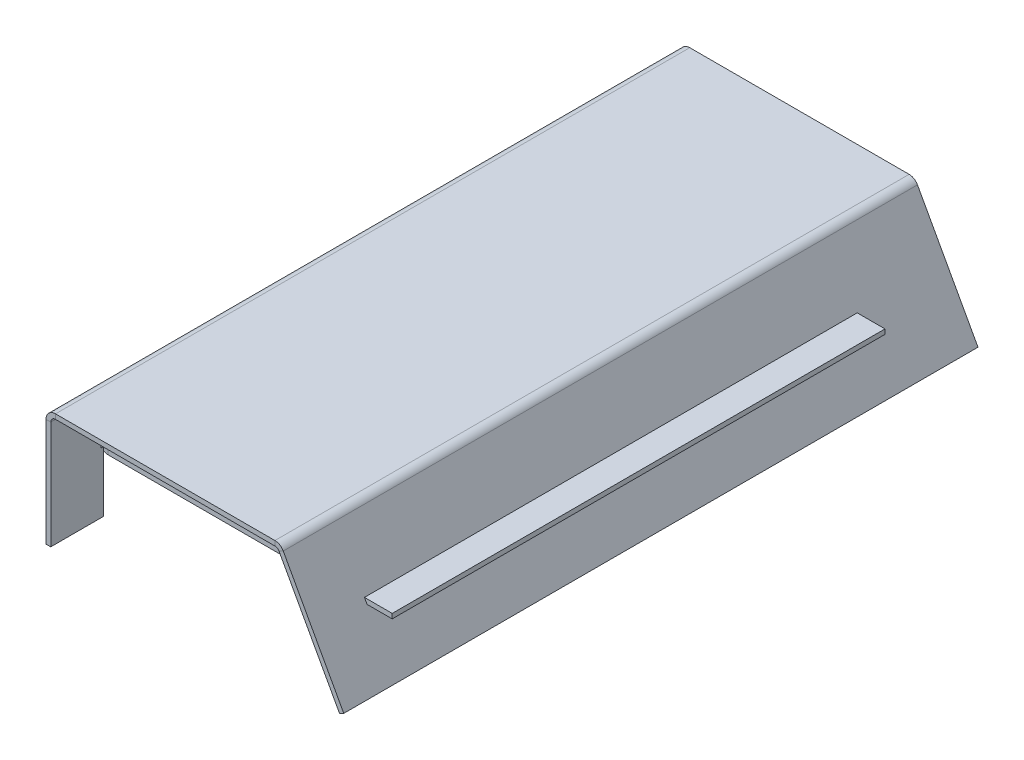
ISO-10303-21;
HEADER;
FILE_DESCRIPTION(('STEP AP214'),'2;1');
FILE_NAME('part.step','',(''),(''),'','','');
FILE_SCHEMA(('AUTOMOTIVE_DESIGN { 1 0 10303 214 1 1 1 1 }'));
ENDSEC;
DATA;
#1=APPLICATION_CONTEXT('core data for automotive mechanical design processes');
#2=APPLICATION_PROTOCOL_DEFINITION('international standard','automotive_design',2000,#1);
#3=PRODUCT_CONTEXT('',#1,'mechanical');
#4=PRODUCT('Part','Part','',(#3));
#5=PRODUCT_RELATED_PRODUCT_CATEGORY('part','',(#4));
#6=PRODUCT_DEFINITION_FORMATION('','',#4);
#7=PRODUCT_DEFINITION_CONTEXT('part definition',#1,'design');
#8=PRODUCT_DEFINITION('design','',#6,#7);
#9=PRODUCT_DEFINITION_SHAPE('','',#8);
#10=(LENGTH_UNIT() NAMED_UNIT(*) SI_UNIT(.MILLI.,.METRE.));
#11=(NAMED_UNIT(*) PLANE_ANGLE_UNIT() SI_UNIT($,.RADIAN.));
#12=(NAMED_UNIT(*) SI_UNIT($,.STERADIAN.) SOLID_ANGLE_UNIT());
#13=UNCERTAINTY_MEASURE_WITH_UNIT(LENGTH_MEASURE(1.E-05),#10,'distance_accuracy_value','');
#14=(GEOMETRIC_REPRESENTATION_CONTEXT(3) GLOBAL_UNCERTAINTY_ASSIGNED_CONTEXT((#13)) GLOBAL_UNIT_ASSIGNED_CONTEXT((#10,
#11,#12)) REPRESENTATION_CONTEXT('',''));
#15=CARTESIAN_POINT('',(0.,0.,0.));
#16=DIRECTION('',(0.,0.,1.));
#17=DIRECTION('',(1.,0.,0.));
#18=AXIS2_PLACEMENT_3D('',#15,#16,#17);
#19=CARTESIAN_POINT('',(-89.5814787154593,20.577072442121,183.41064428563));
#20=DIRECTION('',(0.,0.,1.));
#21=DIRECTION('',(1.,0.,0.));
#22=AXIS2_PLACEMENT_3D('',#19,#20,#21);
#23=PLANE('',#22);
#24=DIRECTION('',(0.,-1.,0.));
#25=VECTOR('',#24,1.);
#26=CARTESIAN_POINT('',(-89.5814787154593,19.077072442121,183.41064428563));
#27=LINE('',#26,#25);
#28=CARTESIAN_POINT('',(-89.5814787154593,19.077072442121,183.41064428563));
#29=VERTEX_POINT('',#28);
#30=CARTESIAN_POINT('',(-89.5814787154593,17.577072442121,183.41064428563));
#31=VERTEX_POINT('',#30);
#32=EDGE_CURVE('E835',#29,#31,#27,.T.);
#33=ORIENTED_EDGE('',*,*,#32,.F.);
#34=CARTESIAN_POINT('',(-89.5814787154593,20.577072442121,183.41064428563));
#35=DIRECTION('',(0.,0.,-1.));
#36=DIRECTION('',(-1.,0.,0.));
#37=AXIS2_PLACEMENT_3D('',#34,#35,#36);
#38=CIRCLE('',#37,1.49999999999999);
#39=CARTESIAN_POINT('',(-91.0814787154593,20.577072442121,183.41064428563));
#40=VERTEX_POINT('',#39);
#41=EDGE_CURVE('E802',#40,#29,#38,.F.);
#42=ORIENTED_EDGE('',*,*,#41,.F.);
#43=DIRECTION('',(-1.,0.,0.));
#44=VECTOR('',#43,1.);
#45=CARTESIAN_POINT('',(-91.0814787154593,20.577072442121,183.41064428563));
#46=LINE('',#45,#44);
#47=CARTESIAN_POINT('',(-92.5814787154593,20.577072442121,183.41064428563));
#48=VERTEX_POINT('',#47);
#49=EDGE_CURVE('E11',#40,#48,#46,.T.);
#50=ORIENTED_EDGE('',*,*,#49,.T.);
#51=CARTESIAN_POINT('',(-89.5814787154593,20.577072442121,183.41064428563));
#52=DIRECTION('',(0.,0.,-1.));
#53=DIRECTION('',(-1.,0.,0.));
#54=AXIS2_PLACEMENT_3D('',#51,#52,#53);
#55=CIRCLE('',#54,2.99999999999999);
#56=EDGE_CURVE('E811',#48,#31,#55,.F.);
#57=ORIENTED_EDGE('',*,*,#56,.T.);
#58=EDGE_LOOP('',(#33,#42,#50,#57));
#59=FACE_BOUND('',#58,.T.);
#60=ADVANCED_FACE('F374',(#59),#23,.T.);
#61=CARTESIAN_POINT('',(-89.5814787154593,20.577072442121,28.0181228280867));
#62=DIRECTION('',(0.,0.,1.));
#63=DIRECTION('',(1.,0.,0.));
#64=AXIS2_PLACEMENT_3D('',#61,#62,#63);
#65=PLANE('',#64);
#66=CARTESIAN_POINT('',(-89.5814787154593,20.577072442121,28.0181228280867));
#67=DIRECTION('',(0.,0.,-1.));
#68=DIRECTION('',(-1.,0.,0.));
#69=AXIS2_PLACEMENT_3D('',#66,#67,#68);
#70=CIRCLE('',#69,1.49999999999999);
#71=CARTESIAN_POINT('',(-89.5814787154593,19.077072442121,28.0181228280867));
#72=VERTEX_POINT('',#71);
#73=CARTESIAN_POINT('',(-91.0814787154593,20.577072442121,28.0181228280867));
#74=VERTEX_POINT('',#73);
#75=EDGE_CURVE('E801',#72,#74,#70,.T.);
#76=ORIENTED_EDGE('',*,*,#75,.F.);
#77=DIRECTION('',(0.,-1.,0.));
#78=VECTOR('',#77,1.);
#79=CARTESIAN_POINT('',(-89.5814787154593,19.077072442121,28.0181228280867));
#80=LINE('',#79,#78);
#81=CARTESIAN_POINT('',(-89.5814787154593,17.577072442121,28.0181228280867));
#82=VERTEX_POINT('',#81);
#83=EDGE_CURVE('E819',#72,#82,#80,.T.);
#84=ORIENTED_EDGE('',*,*,#83,.T.);
#85=CARTESIAN_POINT('',(-89.5814787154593,20.577072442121,28.0181228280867));
#86=DIRECTION('',(0.,0.,-1.));
#87=DIRECTION('',(-1.,0.,0.));
#88=AXIS2_PLACEMENT_3D('',#85,#86,#87);
#89=CIRCLE('',#88,2.99999999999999);
#90=CARTESIAN_POINT('',(-92.5814787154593,20.577072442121,28.0181228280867));
#91=VERTEX_POINT('',#90);
#92=EDGE_CURVE('E805',#82,#91,#89,.T.);
#93=ORIENTED_EDGE('',*,*,#92,.T.);
#94=DIRECTION('',(-1.,0.,0.));
#95=VECTOR('',#94,1.);
#96=CARTESIAN_POINT('',(-91.0814787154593,20.577072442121,28.0181228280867));
#97=LINE('',#96,#95);
#98=EDGE_CURVE('E378',#74,#91,#97,.T.);
#99=ORIENTED_EDGE('',*,*,#98,.F.);
#100=EDGE_LOOP('',(#76,#84,#93,#99));
#101=FACE_BOUND('',#100,.T.);
#102=ADVANCED_FACE('F376',(#101),#65,.F.);
#103=CARTESIAN_POINT('',(-89.5814787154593,20.577072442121,28.0181228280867));
#104=DIRECTION('',(0.,0.,-1.));
#105=DIRECTION('',(0.,-1.,0.));
#106=AXIS2_PLACEMENT_3D('',#103,#104,#105);
#107=CYLINDRICAL_SURFACE('',#106,2.99999999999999);
#108=DIRECTION('',(0.,0.,-1.));
#109=VECTOR('',#108,1.);
#110=CARTESIAN_POINT('',(-92.5814787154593,20.577072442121,28.0181228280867));
#111=LINE('',#110,#109);
#112=EDGE_CURVE('E389',#91,#48,#111,.F.);
#113=ORIENTED_EDGE('',*,*,#112,.F.);
#114=ORIENTED_EDGE('',*,*,#92,.F.);
#115=DIRECTION('',(0.,0.,-1.));
#116=VECTOR('',#115,1.);
#117=CARTESIAN_POINT('',(-89.5814787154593,17.577072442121,28.0181228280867));
#118=LINE('',#117,#116);
#119=EDGE_CURVE('E394',#31,#82,#118,.T.);
#120=ORIENTED_EDGE('',*,*,#119,.F.);
#121=ORIENTED_EDGE('',*,*,#56,.F.);
#122=EDGE_LOOP('',(#113,#114,#120,#121));
#123=FACE_BOUND('',#122,.T.);
#124=ADVANCED_FACE('F858',(#123),#107,.T.);
#125=CARTESIAN_POINT('',(-89.5814787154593,20.577072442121,28.0181228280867));
#126=DIRECTION('',(0.,0.,-1.));
#127=DIRECTION('',(0.,-1.,0.));
#128=AXIS2_PLACEMENT_3D('',#125,#126,#127);
#129=CYLINDRICAL_SURFACE('',#128,1.49999999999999);
#130=DIRECTION('',(0.,0.,-1.));
#131=VECTOR('',#130,1.);
#132=CARTESIAN_POINT('',(-91.0814787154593,20.577072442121,28.0181228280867));
#133=LINE('',#132,#131);
#134=EDGE_CURVE('E806',#74,#40,#133,.F.);
#135=ORIENTED_EDGE('',*,*,#134,.T.);
#136=ORIENTED_EDGE('',*,*,#41,.T.);
#137=DIRECTION('',(0.,0.,-1.));
#138=VECTOR('',#137,1.);
#139=CARTESIAN_POINT('',(-89.5814787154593,19.077072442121,183.41064428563));
#140=LINE('',#139,#138);
#141=EDGE_CURVE('E566',#29,#72,#140,.T.);
#142=ORIENTED_EDGE('',*,*,#141,.T.);
#143=ORIENTED_EDGE('',*,*,#75,.T.);
#144=EDGE_LOOP('',(#135,#136,#142,#143));
#145=FACE_BOUND('',#144,.T.);
#146=ADVANCED_FACE('F833',(#145),#129,.F.);
#147=CARTESIAN_POINT('',(-92.5814787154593,35.577072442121,200.));
#148=DIRECTION('',(1.,0.,0.));
#149=DIRECTION('',(0.,1.,0.));
#150=AXIS2_PLACEMENT_3D('',#147,#148,#149);
#151=PLANE('',#150);
#152=DIRECTION('',(0.,0.,1.));
#153=VECTOR('',#152,1.);
#154=CARTESIAN_POINT('',(-92.5814787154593,19.077072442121,200.));
#155=LINE('',#154,#153);
#156=CARTESIAN_POINT('',(-92.5814787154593,19.077072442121,27.2681228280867));
#157=VERTEX_POINT('',#156);
#158=CARTESIAN_POINT('',(-92.5814787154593,19.077072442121,28.0181228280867));
#159=VERTEX_POINT('',#158);
#160=EDGE_CURVE('E638',#157,#159,#155,.T.);
#161=ORIENTED_EDGE('',*,*,#160,.F.);
#162=DIRECTION('',(0.,-1.,0.));
#163=VECTOR('',#162,1.);
#164=CARTESIAN_POINT('',(-92.5814787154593,35.577072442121,27.2681228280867));
#165=LINE('',#164,#163);
#166=CARTESIAN_POINT('',(-92.5814787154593,21.327072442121,27.2681228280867));
#167=VERTEX_POINT('',#166);
#168=EDGE_CURVE('E656',#167,#157,#165,.T.);
#169=ORIENTED_EDGE('',*,*,#168,.F.);
#170=DIRECTION('',(0.,0.,-1.));
#171=VECTOR('',#170,1.);
#172=CARTESIAN_POINT('',(-92.5814787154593,21.327072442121,200.));
#173=LINE('',#172,#171);
#174=CARTESIAN_POINT('',(-92.5814787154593,21.327072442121,28.0181228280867));
#175=VERTEX_POINT('',#174);
#176=EDGE_CURVE('E653',#175,#167,#173,.T.);
#177=ORIENTED_EDGE('',*,*,#176,.F.);
#178=DIRECTION('',(0.,1.,0.));
#179=VECTOR('',#178,1.);
#180=CARTESIAN_POINT('',(-92.5814787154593,35.577072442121,28.0181228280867));
#181=LINE('',#180,#179);
#182=EDGE_CURVE('E650',#91,#175,#181,.T.);
#183=ORIENTED_EDGE('',*,*,#182,.F.);
#184=ORIENTED_EDGE('',*,*,#112,.T.);
#185=DIRECTION('',(0.,-1.,0.));
#186=VECTOR('',#185,1.);
#187=CARTESIAN_POINT('',(-92.5814787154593,35.577072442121,183.41064428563));
#188=LINE('',#187,#186);
#189=CARTESIAN_POINT('',(-92.5814787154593,21.327072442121,183.41064428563));
#190=VERTEX_POINT('',#189);
#191=EDGE_CURVE('E647',#190,#48,#188,.T.);
#192=ORIENTED_EDGE('',*,*,#191,.F.);
#193=DIRECTION('',(0.,0.,-1.));
#194=VECTOR('',#193,1.);
#195=CARTESIAN_POINT('',(-92.5814787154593,21.327072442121,200.));
#196=LINE('',#195,#194);
#197=CARTESIAN_POINT('',(-92.5814787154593,21.327072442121,184.16064428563));
#198=VERTEX_POINT('',#197);
#199=EDGE_CURVE('E644',#198,#190,#196,.T.);
#200=ORIENTED_EDGE('',*,*,#199,.F.);
#201=DIRECTION('',(0.,1.,0.));
#202=VECTOR('',#201,1.);
#203=CARTESIAN_POINT('',(-92.5814787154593,35.577072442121,184.16064428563));
#204=LINE('',#203,#202);
#205=CARTESIAN_POINT('',(-92.5814787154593,19.077072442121,184.16064428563));
#206=VERTEX_POINT('',#205);
#207=EDGE_CURVE('E641',#206,#198,#204,.T.);
#208=ORIENTED_EDGE('',*,*,#207,.F.);
#209=DIRECTION('',(0.,0.,1.));
#210=VECTOR('',#209,1.);
#211=CARTESIAN_POINT('',(-92.5814787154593,19.077072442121,200.));
#212=LINE('',#211,#210);
#213=CARTESIAN_POINT('',(-92.5814787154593,19.077072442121,183.41064428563));
#214=VERTEX_POINT('',#213);
#215=EDGE_CURVE('E597',#214,#206,#212,.T.);
#216=ORIENTED_EDGE('',*,*,#215,.F.);
#217=DIRECTION('',(0.,1.,0.));
#218=VECTOR('',#217,1.);
#219=CARTESIAN_POINT('',(-92.5814787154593,0.,183.41064428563));
#220=LINE('',#219,#218);
#221=CARTESIAN_POINT('',(-92.5814787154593,0.,183.41064428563));
#222=VERTEX_POINT('',#221);
#223=EDGE_CURVE('E661',#222,#214,#220,.T.);
#224=ORIENTED_EDGE('',*,*,#223,.F.);
#225=DIRECTION('',(0.,0.,-1.));
#226=VECTOR('',#225,1.);
#227=CARTESIAN_POINT('',(-92.5814787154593,0.,200.));
#228=LINE('',#227,#226);
#229=CARTESIAN_POINT('',(-92.5814787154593,0.,200.));
#230=VERTEX_POINT('',#229);
#231=EDGE_CURVE('E777',#230,#222,#228,.T.);
#232=ORIENTED_EDGE('',*,*,#231,.F.);
#233=DIRECTION('',(0.,-1.,0.));
#234=VECTOR('',#233,1.);
#235=CARTESIAN_POINT('',(-92.5814787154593,35.577072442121,200.));
#236=LINE('',#235,#234);
#237=CARTESIAN_POINT('',(-92.5814787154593,34.077072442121,200.));
#238=VERTEX_POINT('',#237);
#239=EDGE_CURVE('E709',#238,#230,#236,.T.);
#240=ORIENTED_EDGE('',*,*,#239,.F.);
#241=DIRECTION('',(0.,0.,-1.));
#242=VECTOR('',#241,1.);
#243=CARTESIAN_POINT('',(-92.5814787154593,34.077072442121,200.));
#244=LINE('',#243,#242);
#245=CARTESIAN_POINT('',(-92.5814787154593,34.077072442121,0.));
#246=VERTEX_POINT('',#245);
#247=EDGE_CURVE('E744',#238,#246,#244,.T.);
#248=ORIENTED_EDGE('',*,*,#247,.T.);
#249=DIRECTION('',(0.,-1.,0.));
#250=VECTOR('',#249,1.);
#251=CARTESIAN_POINT('',(-92.5814787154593,35.577072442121,0.));
#252=LINE('',#251,#250);
#253=CARTESIAN_POINT('',(-92.5814787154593,0.,0.));
#254=VERTEX_POINT('',#253);
#255=EDGE_CURVE('E666',#246,#254,#252,.T.);
#256=ORIENTED_EDGE('',*,*,#255,.T.);
#257=CARTESIAN_POINT('',(-92.5814787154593,0.,28.0181228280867));
#258=VERTEX_POINT('',#257);
#259=EDGE_CURVE('E776',#258,#254,#228,.T.);
#260=ORIENTED_EDGE('',*,*,#259,.F.);
#261=DIRECTION('',(0.,-1.,0.));
#262=VECTOR('',#261,1.);
#263=CARTESIAN_POINT('',(-92.5814787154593,0.,28.0181228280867));
#264=LINE('',#263,#262);
#265=EDGE_CURVE('E659',#159,#258,#264,.T.);
#266=ORIENTED_EDGE('',*,*,#265,.F.);
#267=EDGE_LOOP('',(#161,#169,#177,#183,#184,#192,#200,#208,#216,#224,#232,#240,#248,#256,#260,#266));
#268=FACE_BOUND('',#267,.T.);
#269=ADVANCED_FACE('F821',(#268),#151,.F.);
#270=CARTESIAN_POINT('',(-91.0814787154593,35.577072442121,200.));
#271=DIRECTION('',(1.,0.,0.));
#272=DIRECTION('',(0.,1.,0.));
#273=AXIS2_PLACEMENT_3D('',#270,#271,#272);
#274=PLANE('',#273);
#275=DIRECTION('',(0.,1.,0.));
#276=VECTOR('',#275,1.);
#277=CARTESIAN_POINT('',(-91.0814787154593,19.077072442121,27.2681228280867));
#278=LINE('',#277,#276);
#279=CARTESIAN_POINT('',(-91.0814787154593,19.077072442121,27.2681228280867));
#280=VERTEX_POINT('',#279);
#281=CARTESIAN_POINT('',(-91.0814787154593,21.327072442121,27.2681228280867));
#282=VERTEX_POINT('',#281);
#283=EDGE_CURVE('E598',#280,#282,#278,.T.);
#284=ORIENTED_EDGE('',*,*,#283,.F.);
#285=DIRECTION('',(0.,0.,-1.));
#286=VECTOR('',#285,1.);
#287=CARTESIAN_POINT('',(-91.0814787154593,19.077072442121,28.0181228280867));
#288=LINE('',#287,#286);
#289=CARTESIAN_POINT('',(-91.0814787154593,19.077072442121,28.0181228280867));
#290=VERTEX_POINT('',#289);
#291=EDGE_CURVE('E594',#290,#280,#288,.T.);
#292=ORIENTED_EDGE('',*,*,#291,.F.);
#293=DIRECTION('',(0.,1.,0.));
#294=VECTOR('',#293,1.);
#295=CARTESIAN_POINT('',(-91.0814787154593,35.577072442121,28.0181228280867));
#296=LINE('',#295,#294);
#297=CARTESIAN_POINT('',(-91.0814787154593,0.,28.0181228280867));
#298=VERTEX_POINT('',#297);
#299=EDGE_CURVE('E798',#298,#290,#296,.T.);
#300=ORIENTED_EDGE('',*,*,#299,.F.);
#301=DIRECTION('',(0.,0.,-1.));
#302=VECTOR('',#301,1.);
#303=CARTESIAN_POINT('',(-91.0814787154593,0.,200.));
#304=LINE('',#303,#302);
#305=CARTESIAN_POINT('',(-91.0814787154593,0.,0.));
#306=VERTEX_POINT('',#305);
#307=EDGE_CURVE('E772',#298,#306,#304,.T.);
#308=ORIENTED_EDGE('',*,*,#307,.T.);
#309=DIRECTION('',(0.,-1.,0.));
#310=VECTOR('',#309,1.);
#311=CARTESIAN_POINT('',(-91.0814787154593,35.577072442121,0.));
#312=LINE('',#311,#310);
#313=CARTESIAN_POINT('',(-91.0814787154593,34.077072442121,0.));
#314=VERTEX_POINT('',#313);
#315=EDGE_CURVE('E679',#314,#306,#312,.T.);
#316=ORIENTED_EDGE('',*,*,#315,.F.);
#317=DIRECTION('',(0.,0.,-1.));
#318=VECTOR('',#317,1.);
#319=CARTESIAN_POINT('',(-91.0814787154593,34.077072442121,200.));
#320=LINE('',#319,#318);
#321=CARTESIAN_POINT('',(-91.0814787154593,34.077072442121,200.));
#322=VERTEX_POINT('',#321);
#323=EDGE_CURVE('E769',#322,#314,#320,.T.);
#324=ORIENTED_EDGE('',*,*,#323,.F.);
#325=DIRECTION('',(0.,-1.,0.));
#326=VECTOR('',#325,1.);
#327=CARTESIAN_POINT('',(-91.0814787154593,35.577072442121,200.));
#328=LINE('',#327,#326);
#329=CARTESIAN_POINT('',(-91.0814787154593,0.,200.));
#330=VERTEX_POINT('',#329);
#331=EDGE_CURVE('E714',#322,#330,#328,.T.);
#332=ORIENTED_EDGE('',*,*,#331,.T.);
#333=CARTESIAN_POINT('',(-91.0814787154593,0.,183.41064428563));
#334=VERTEX_POINT('',#333);
#335=EDGE_CURVE('E773',#330,#334,#304,.T.);
#336=ORIENTED_EDGE('',*,*,#335,.T.);
#337=DIRECTION('',(0.,-1.,0.));
#338=VECTOR('',#337,1.);
#339=CARTESIAN_POINT('',(-91.0814787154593,35.577072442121,183.41064428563));
#340=LINE('',#339,#338);
#341=CARTESIAN_POINT('',(-91.0814787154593,19.077072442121,183.41064428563));
#342=VERTEX_POINT('',#341);
#343=EDGE_CURVE('E796',#342,#334,#340,.T.);
#344=ORIENTED_EDGE('',*,*,#343,.F.);
#345=DIRECTION('',(0.,0.,-1.));
#346=VECTOR('',#345,1.);
#347=CARTESIAN_POINT('',(-91.0814787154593,19.077072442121,184.16064428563));
#348=LINE('',#347,#346);
#349=CARTESIAN_POINT('',(-91.0814787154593,19.077072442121,184.16064428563));
#350=VERTEX_POINT('',#349);
#351=EDGE_CURVE('E621',#350,#342,#348,.T.);
#352=ORIENTED_EDGE('',*,*,#351,.F.);
#353=DIRECTION('',(0.,-1.,0.));
#354=VECTOR('',#353,1.);
#355=CARTESIAN_POINT('',(-91.0814787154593,21.327072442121,184.16064428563));
#356=LINE('',#355,#354);
#357=CARTESIAN_POINT('',(-91.0814787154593,21.327072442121,184.16064428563));
#358=VERTEX_POINT('',#357);
#359=EDGE_CURVE('E617',#358,#350,#356,.T.);
#360=ORIENTED_EDGE('',*,*,#359,.F.);
#361=DIRECTION('',(0.,0.,1.));
#362=VECTOR('',#361,1.);
#363=CARTESIAN_POINT('',(-91.0814787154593,21.327072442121,183.41064428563));
#364=LINE('',#363,#362);
#365=CARTESIAN_POINT('',(-91.0814787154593,21.327072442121,183.41064428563));
#366=VERTEX_POINT('',#365);
#367=EDGE_CURVE('E613',#366,#358,#364,.T.);
#368=ORIENTED_EDGE('',*,*,#367,.F.);
#369=DIRECTION('',(0.,1.,0.));
#370=VECTOR('',#369,1.);
#371=CARTESIAN_POINT('',(-91.0814787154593,20.577072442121,183.41064428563));
#372=LINE('',#371,#370);
#373=EDGE_CURVE('E610',#40,#366,#372,.T.);
#374=ORIENTED_EDGE('',*,*,#373,.F.);
#375=ORIENTED_EDGE('',*,*,#134,.F.);
#376=DIRECTION('',(0.,-1.,0.));
#377=VECTOR('',#376,1.);
#378=CARTESIAN_POINT('',(-91.0814787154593,21.327072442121,28.0181228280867));
#379=LINE('',#378,#377);
#380=CARTESIAN_POINT('',(-91.0814787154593,21.327072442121,28.0181228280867));
#381=VERTEX_POINT('',#380);
#382=EDGE_CURVE('E606',#381,#74,#379,.T.);
#383=ORIENTED_EDGE('',*,*,#382,.F.);
#384=DIRECTION('',(0.,0.,1.));
#385=VECTOR('',#384,1.);
#386=CARTESIAN_POINT('',(-91.0814787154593,21.327072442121,27.2681228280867));
#387=LINE('',#386,#385);
#388=EDGE_CURVE('E602',#282,#381,#387,.T.);
#389=ORIENTED_EDGE('',*,*,#388,.F.);
#390=EDGE_LOOP('',(#284,#292,#300,#308,#316,#324,#332,#336,#344,#352,#360,#368,#374,#375,#383,#389));
#391=FACE_BOUND('',#390,.T.);
#392=ADVANCED_FACE('F827',(#391),#274,.T.);
#393=CARTESIAN_POINT('',(-91.0814787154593,0.,200.));
#394=DIRECTION('',(0.,-1.,0.));
#395=DIRECTION('',(0.,0.,-1.));
#396=AXIS2_PLACEMENT_3D('',#393,#394,#395);
#397=PLANE('',#396);
#398=DIRECTION('',(-1.,0.,0.));
#399=VECTOR('',#398,1.);
#400=CARTESIAN_POINT('',(-82.5814787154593,0.,28.0181228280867));
#401=LINE('',#400,#399);
#402=EDGE_CURVE('E663',#298,#258,#401,.T.);
#403=ORIENTED_EDGE('',*,*,#402,.T.);
#404=ORIENTED_EDGE('',*,*,#259,.T.);
#405=DIRECTION('',(-1.,0.,0.));
#406=VECTOR('',#405,1.);
#407=CARTESIAN_POINT('',(-91.0814787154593,0.,0.));
#408=LINE('',#407,#406);
#409=EDGE_CURVE('E676',#306,#254,#408,.T.);
#410=ORIENTED_EDGE('',*,*,#409,.F.);
#411=ORIENTED_EDGE('',*,*,#307,.F.);
#412=EDGE_LOOP('',(#403,#404,#410,#411));
#413=FACE_BOUND('',#412,.T.);
#414=ADVANCED_FACE('F873',(#413),#397,.T.);
#415=CARTESIAN_POINT('',(-20.3981690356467,35.577072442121,200.));
#416=DIRECTION('',(0.,0.,1.));
#417=DIRECTION('',(1.,0.,0.));
#418=AXIS2_PLACEMENT_3D('',#415,#416,#417);
#419=PLANE('',#418);
#420=DIRECTION('',(0.,1.,0.));
#421=VECTOR('',#420,1.);
#422=CARTESIAN_POINT('',(-20.3981690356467,35.577072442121,200.));
#423=LINE('',#422,#421);
#424=CARTESIAN_POINT('',(-20.3981690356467,35.577072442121,200.));
#425=VERTEX_POINT('',#424);
#426=CARTESIAN_POINT('',(-20.3981690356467,37.077072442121,200.));
#427=VERTEX_POINT('',#426);
#428=EDGE_CURVE('E794',#425,#427,#423,.T.);
#429=ORIENTED_EDGE('',*,*,#428,.F.);
#430=CARTESIAN_POINT('',(-20.3981690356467,34.077072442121,200.));
#431=DIRECTION('',(0.,0.,-1.));
#432=DIRECTION('',(-1.,0.,0.));
#433=AXIS2_PLACEMENT_3D('',#430,#431,#432);
#434=CIRCLE('',#433,1.5);
#435=CARTESIAN_POINT('',(-19.0829504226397,34.7983213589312,200.));
#436=VERTEX_POINT('',#435);
#437=EDGE_CURVE('E723',#436,#425,#434,.F.);
#438=ORIENTED_EDGE('',*,*,#437,.F.);
#439=DIRECTION('',(-0.876812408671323,-0.480832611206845,0.));
#440=VECTOR('',#439,1.);
#441=CARTESIAN_POINT('',(-17.7677318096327,35.5195702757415,200.));
#442=LINE('',#441,#440);
#443=CARTESIAN_POINT('',(-17.7677318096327,35.5195702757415,200.));
#444=VERTEX_POINT('',#443);
#445=EDGE_CURVE('E792',#444,#436,#442,.T.);
#446=ORIENTED_EDGE('',*,*,#445,.F.);
#447=CARTESIAN_POINT('',(-20.3981690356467,34.077072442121,200.));
#448=DIRECTION('',(0.,0.,1.));
#449=DIRECTION('',(1.,0.,0.));
#450=AXIS2_PLACEMENT_3D('',#447,#448,#449);
#451=CIRCLE('',#450,3.);
#452=EDGE_CURVE('E735',#444,#427,#451,.T.);
#453=ORIENTED_EDGE('',*,*,#452,.T.);
#454=EDGE_LOOP('',(#429,#438,#446,#453));
#455=FACE_BOUND('',#454,.T.);
#456=ADVANCED_FACE('F869',(#455),#419,.T.);
#457=CARTESIAN_POINT('',(-17.7677318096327,35.5195702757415,200.));
#458=DIRECTION('',(0.,0.,1.));
#459=DIRECTION('',(1.,0.,0.));
#460=AXIS2_PLACEMENT_3D('',#457,#458,#459);
#461=PLANE('',#460);
#462=DIRECTION('',(-1.,0.,0.));
#463=VECTOR('',#462,1.);
#464=CARTESIAN_POINT('',(-19.5100074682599,35.577072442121,200.));
#465=LINE('',#464,#463);
#466=CARTESIAN_POINT('',(-89.5814787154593,35.577072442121,200.));
#467=VERTEX_POINT('',#466);
#468=EDGE_CURVE('E720',#425,#467,#465,.T.);
#469=ORIENTED_EDGE('',*,*,#468,.F.);
#470=ORIENTED_EDGE('',*,*,#428,.T.);
#471=DIRECTION('',(1.,0.,0.));
#472=VECTOR('',#471,1.);
#473=CARTESIAN_POINT('',(-19.5100074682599,37.077072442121,200.));
#474=LINE('',#473,#472);
#475=CARTESIAN_POINT('',(-89.5814787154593,37.077072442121,200.));
#476=VERTEX_POINT('',#475);
#477=EDGE_CURVE('E738',#427,#476,#474,.F.);
#478=ORIENTED_EDGE('',*,*,#477,.T.);
#479=DIRECTION('',(0.,-1.,0.));
#480=VECTOR('',#479,1.);
#481=CARTESIAN_POINT('',(-89.5814787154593,37.077072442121,200.));
#482=LINE('',#481,#480);
#483=EDGE_CURVE('E784',#476,#467,#482,.T.);
#484=ORIENTED_EDGE('',*,*,#483,.T.);
#485=EDGE_LOOP('',(#469,#470,#478,#484));
#486=FACE_BOUND('',#485,.T.);
#487=ADVANCED_FACE('F872',(#486),#461,.T.);
#488=CARTESIAN_POINT('',(-19.0829504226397,34.7983213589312,0.));
#489=DIRECTION('',(0.,0.,-1.));
#490=DIRECTION('',(-1.,0.,0.));
#491=AXIS2_PLACEMENT_3D('',#488,#489,#490);
#492=PLANE('',#491);
#493=DIRECTION('',(0.876812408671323,0.480832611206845,0.));
#494=VECTOR('',#493,1.);
#495=CARTESIAN_POINT('',(-19.0829504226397,34.7983213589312,0.));
#496=LINE('',#495,#494);
#497=CARTESIAN_POINT('',(-19.0829504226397,34.7983213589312,0.));
#498=VERTEX_POINT('',#497);
#499=CARTESIAN_POINT('',(-17.7677318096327,35.5195702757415,0.));
#500=VERTEX_POINT('',#499);
#501=EDGE_CURVE('E790',#498,#500,#496,.T.);
#502=ORIENTED_EDGE('',*,*,#501,.F.);
#503=CARTESIAN_POINT('',(-20.3981690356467,34.077072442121,0.));
#504=DIRECTION('',(0.,0.,-1.));
#505=DIRECTION('',(-1.,0.,0.));
#506=AXIS2_PLACEMENT_3D('',#503,#504,#505);
#507=CIRCLE('',#506,1.5);
#508=CARTESIAN_POINT('',(-20.3981690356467,35.577072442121,0.));
#509=VERTEX_POINT('',#508);
#510=EDGE_CURVE('E688',#498,#509,#507,.F.);
#511=ORIENTED_EDGE('',*,*,#510,.T.);
#512=DIRECTION('',(0.,-1.,0.));
#513=VECTOR('',#512,1.);
#514=CARTESIAN_POINT('',(-20.3981690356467,37.077072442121,0.));
#515=LINE('',#514,#513);
#516=CARTESIAN_POINT('',(-20.3981690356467,37.077072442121,0.));
#517=VERTEX_POINT('',#516);
#518=EDGE_CURVE('E788',#517,#509,#515,.T.);
#519=ORIENTED_EDGE('',*,*,#518,.F.);
#520=CARTESIAN_POINT('',(-20.3981690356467,34.077072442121,0.));
#521=DIRECTION('',(0.,0.,1.));
#522=DIRECTION('',(1.,0.,0.));
#523=AXIS2_PLACEMENT_3D('',#520,#521,#522);
#524=CIRCLE('',#523,3.);
#525=EDGE_CURVE('E700',#500,#517,#524,.T.);
#526=ORIENTED_EDGE('',*,*,#525,.F.);
#527=EDGE_LOOP('',(#502,#511,#519,#526));
#528=FACE_BOUND('',#527,.T.);
#529=ADVANCED_FACE('F877',(#528),#492,.T.);
#530=CARTESIAN_POINT('',(-20.3981690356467,37.077072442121,0.));
#531=DIRECTION('',(0.,0.,-1.));
#532=DIRECTION('',(-1.,0.,0.));
#533=AXIS2_PLACEMENT_3D('',#530,#531,#532);
#534=PLANE('',#533);
#535=DIRECTION('',(-0.480832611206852,0.876812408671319,0.));
#536=VECTOR('',#535,1.);
#537=CARTESIAN_POINT('',(0.,0.,0.));
#538=LINE('',#537,#536);
#539=CARTESIAN_POINT('',(0.,0.,0.));
#540=VERTEX_POINT('',#539);
#541=EDGE_CURVE('E691',#540,#498,#538,.T.);
#542=ORIENTED_EDGE('',*,*,#541,.T.);
#543=ORIENTED_EDGE('',*,*,#501,.T.);
#544=DIRECTION('',(-0.480832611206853,0.876812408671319,0.));
#545=VECTOR('',#544,1.);
#546=CARTESIAN_POINT('',(1.31521861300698,0.721248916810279,0.));
#547=LINE('',#546,#545);
#548=CARTESIAN_POINT('',(1.31521861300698,0.721248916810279,0.));
#549=VERTEX_POINT('',#548);
#550=EDGE_CURVE('E697',#549,#500,#547,.T.);
#551=ORIENTED_EDGE('',*,*,#550,.F.);
#552=DIRECTION('',(-0.876812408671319,-0.480832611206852,0.));
#553=VECTOR('',#552,1.);
#554=CARTESIAN_POINT('',(1.31521861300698,0.721248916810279,0.));
#555=LINE('',#554,#553);
#556=EDGE_CURVE('E694',#549,#540,#555,.T.);
#557=ORIENTED_EDGE('',*,*,#556,.T.);
#558=EDGE_LOOP('',(#542,#543,#551,#557));
#559=FACE_BOUND('',#558,.T.);
#560=ADVANCED_FACE('F881',(#559),#534,.T.);
#561=CARTESIAN_POINT('',(-91.0814787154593,34.077072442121,200.));
#562=DIRECTION('',(0.,0.,1.));
#563=DIRECTION('',(1.,0.,0.));
#564=AXIS2_PLACEMENT_3D('',#561,#562,#563);
#565=PLANE('',#564);
#566=DIRECTION('',(-1.,0.,0.));
#567=VECTOR('',#566,1.);
#568=CARTESIAN_POINT('',(-91.0814787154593,34.077072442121,200.));
#569=LINE('',#568,#567);
#570=EDGE_CURVE('E786',#322,#238,#569,.T.);
#571=ORIENTED_EDGE('',*,*,#570,.F.);
#572=CARTESIAN_POINT('',(-89.5814787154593,34.077072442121,200.));
#573=DIRECTION('',(0.,0.,-1.));
#574=DIRECTION('',(-1.,0.,0.));
#575=AXIS2_PLACEMENT_3D('',#572,#573,#574);
#576=CIRCLE('',#575,1.5);
#577=EDGE_CURVE('E717',#467,#322,#576,.F.);
#578=ORIENTED_EDGE('',*,*,#577,.F.);
#579=ORIENTED_EDGE('',*,*,#483,.F.);
#580=CARTESIAN_POINT('',(-89.5814787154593,34.077072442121,200.));
#581=DIRECTION('',(0.,0.,1.));
#582=DIRECTION('',(1.,0.,0.));
#583=AXIS2_PLACEMENT_3D('',#580,#581,#582);
#584=CIRCLE('',#583,3.);
#585=EDGE_CURVE('E741',#476,#238,#584,.T.);
#586=ORIENTED_EDGE('',*,*,#585,.T.);
#587=EDGE_LOOP('',(#571,#578,#579,#586));
#588=FACE_BOUND('',#587,.T.);
#589=ADVANCED_FACE('F885',(#588),#565,.T.);
#590=CARTESIAN_POINT('',(-89.5814787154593,37.077072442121,200.));
#591=DIRECTION('',(0.,0.,1.));
#592=DIRECTION('',(1.,0.,0.));
#593=AXIS2_PLACEMENT_3D('',#590,#591,#592);
#594=PLANE('',#593);
#595=ORIENTED_EDGE('',*,*,#331,.F.);
#596=ORIENTED_EDGE('',*,*,#570,.T.);
#597=ORIENTED_EDGE('',*,*,#239,.T.);
#598=DIRECTION('',(-1.,0.,0.));
#599=VECTOR('',#598,1.);
#600=CARTESIAN_POINT('',(-91.0814787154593,0.,200.));
#601=LINE('',#600,#599);
#602=EDGE_CURVE('E711',#330,#230,#601,.T.);
#603=ORIENTED_EDGE('',*,*,#602,.F.);
#604=EDGE_LOOP('',(#595,#596,#597,#603));
#605=FACE_BOUND('',#604,.T.);
#606=ADVANCED_FACE('F889',(#605),#594,.T.);
#607=CARTESIAN_POINT('',(-89.5814787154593,35.577072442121,0.));
#608=DIRECTION('',(0.,0.,-1.));
#609=DIRECTION('',(-1.,0.,0.));
#610=AXIS2_PLACEMENT_3D('',#607,#608,#609);
#611=PLANE('',#610);
#612=DIRECTION('',(0.,1.,0.));
#613=VECTOR('',#612,1.);
#614=CARTESIAN_POINT('',(-89.5814787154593,35.577072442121,0.));
#615=LINE('',#614,#613);
#616=CARTESIAN_POINT('',(-89.5814787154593,35.577072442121,0.));
#617=VERTEX_POINT('',#616);
#618=CARTESIAN_POINT('',(-89.5814787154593,37.077072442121,0.));
#619=VERTEX_POINT('',#618);
#620=EDGE_CURVE('E782',#617,#619,#615,.T.);
#621=ORIENTED_EDGE('',*,*,#620,.F.);
#622=CARTESIAN_POINT('',(-89.5814787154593,34.077072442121,0.));
#623=DIRECTION('',(0.,0.,-1.));
#624=DIRECTION('',(-1.,0.,0.));
#625=AXIS2_PLACEMENT_3D('',#622,#623,#624);
#626=CIRCLE('',#625,1.5);
#627=EDGE_CURVE('E682',#617,#314,#626,.F.);
#628=ORIENTED_EDGE('',*,*,#627,.T.);
#629=DIRECTION('',(1.,0.,0.));
#630=VECTOR('',#629,1.);
#631=CARTESIAN_POINT('',(-92.5814787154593,34.077072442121,0.));
#632=LINE('',#631,#630);
#633=EDGE_CURVE('E780',#246,#314,#632,.T.);
#634=ORIENTED_EDGE('',*,*,#633,.F.);
#635=CARTESIAN_POINT('',(-89.5814787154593,34.077072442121,0.));
#636=DIRECTION('',(0.,0.,1.));
#637=DIRECTION('',(1.,0.,0.));
#638=AXIS2_PLACEMENT_3D('',#635,#636,#637);
#639=CIRCLE('',#638,3.);
#640=EDGE_CURVE('E706',#619,#246,#639,.T.);
#641=ORIENTED_EDGE('',*,*,#640,.F.);
#642=EDGE_LOOP('',(#621,#628,#634,#641));
#643=FACE_BOUND('',#642,.T.);
#644=ADVANCED_FACE('F893',(#643),#611,.T.);
#645=CARTESIAN_POINT('',(-92.5814787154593,34.077072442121,0.));
#646=DIRECTION('',(0.,0.,-1.));
#647=DIRECTION('',(-1.,0.,0.));
#648=AXIS2_PLACEMENT_3D('',#645,#646,#647);
#649=PLANE('',#648);
#650=DIRECTION('',(-1.,0.,0.));
#651=VECTOR('',#650,1.);
#652=CARTESIAN_POINT('',(-19.5100074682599,35.577072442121,0.));
#653=LINE('',#652,#651);
#654=EDGE_CURVE('E685',#509,#617,#653,.T.);
#655=ORIENTED_EDGE('',*,*,#654,.T.);
#656=ORIENTED_EDGE('',*,*,#620,.T.);
#657=DIRECTION('',(1.,0.,0.));
#658=VECTOR('',#657,1.);
#659=CARTESIAN_POINT('',(-19.5100074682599,37.077072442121,0.));
#660=LINE('',#659,#658);
#661=EDGE_CURVE('E703',#517,#619,#660,.F.);
#662=ORIENTED_EDGE('',*,*,#661,.F.);
#663=ORIENTED_EDGE('',*,*,#518,.T.);
#664=EDGE_LOOP('',(#655,#656,#662,#663));
#665=FACE_BOUND('',#664,.T.);
#666=ADVANCED_FACE('F897',(#665),#649,.T.);
#667=DIRECTION('',(-1.,0.,0.));
#668=VECTOR('',#667,1.);
#669=CARTESIAN_POINT('',(-82.5814787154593,0.,183.41064428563));
#670=LINE('',#669,#668);
#671=EDGE_CURVE('E670',#334,#222,#670,.T.);
#672=ORIENTED_EDGE('',*,*,#671,.F.);
#673=ORIENTED_EDGE('',*,*,#335,.F.);
#674=ORIENTED_EDGE('',*,*,#602,.T.);
#675=ORIENTED_EDGE('',*,*,#231,.T.);
#676=EDGE_LOOP('',(#672,#673,#674,#675));
#677=FACE_BOUND('',#676,.T.);
#678=ADVANCED_FACE('F901',(#677),#397,.T.);
#679=CARTESIAN_POINT('',(-89.5814787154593,34.077072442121,200.));
#680=DIRECTION('',(0.,0.,-1.));
#681=DIRECTION('',(-1.,0.,0.));
#682=AXIS2_PLACEMENT_3D('',#679,#680,#681);
#683=CYLINDRICAL_SURFACE('',#682,1.5);
#684=ORIENTED_EDGE('',*,*,#627,.F.);
#685=DIRECTION('',(0.,0.,-1.));
#686=VECTOR('',#685,1.);
#687=CARTESIAN_POINT('',(-89.5814787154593,35.577072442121,200.));
#688=LINE('',#687,#686);
#689=EDGE_CURVE('E766',#467,#617,#688,.T.);
#690=ORIENTED_EDGE('',*,*,#689,.F.);
#691=ORIENTED_EDGE('',*,*,#577,.T.);
#692=ORIENTED_EDGE('',*,*,#323,.T.);
#693=EDGE_LOOP('',(#684,#690,#691,#692));
#694=FACE_BOUND('',#693,.T.);
#695=ADVANCED_FACE('F907',(#694),#683,.F.);
#696=CARTESIAN_POINT('',(-19.5100074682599,35.577072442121,200.));
#697=DIRECTION('',(0.,-1.,0.));
#698=DIRECTION('',(0.,0.,-1.));
#699=AXIS2_PLACEMENT_3D('',#696,#697,#698);
#700=PLANE('',#699);
#701=ORIENTED_EDGE('',*,*,#654,.F.);
#702=DIRECTION('',(0.,0.,-1.));
#703=VECTOR('',#702,1.);
#704=CARTESIAN_POINT('',(-20.3981690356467,35.577072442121,200.));
#705=LINE('',#704,#703);
#706=EDGE_CURVE('E763',#425,#509,#705,.T.);
#707=ORIENTED_EDGE('',*,*,#706,.F.);
#708=ORIENTED_EDGE('',*,*,#468,.T.);
#709=ORIENTED_EDGE('',*,*,#689,.T.);
#710=EDGE_LOOP('',(#701,#707,#708,#709));
#711=FACE_BOUND('',#710,.T.);
#712=ADVANCED_FACE('F913',(#711),#700,.T.);
#713=CARTESIAN_POINT('',(-20.3981690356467,34.077072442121,200.));
#714=DIRECTION('',(0.,0.,-1.));
#715=DIRECTION('',(-1.,0.,0.));
#716=AXIS2_PLACEMENT_3D('',#713,#714,#715);
#717=CYLINDRICAL_SURFACE('',#716,1.5);
#718=ORIENTED_EDGE('',*,*,#510,.F.);
#719=DIRECTION('',(0.,0.,-1.));
#720=VECTOR('',#719,1.);
#721=CARTESIAN_POINT('',(-19.0829504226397,34.7983213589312,200.));
#722=LINE('',#721,#720);
#723=EDGE_CURVE('E760',#436,#498,#722,.T.);
#724=ORIENTED_EDGE('',*,*,#723,.F.);
#725=ORIENTED_EDGE('',*,*,#437,.T.);
#726=ORIENTED_EDGE('',*,*,#706,.T.);
#727=EDGE_LOOP('',(#718,#724,#725,#726));
#728=FACE_BOUND('',#727,.T.);
#729=ADVANCED_FACE('F917',(#728),#717,.F.);
#730=CARTESIAN_POINT('',(0.,0.,200.));
#731=DIRECTION('',(-0.876812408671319,-0.480832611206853,0.));
#732=DIRECTION('',(0.480832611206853,-0.876812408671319,0.));
#733=AXIS2_PLACEMENT_3D('',#730,#731,#732);
#734=PLANE('',#733);
#735=ORIENTED_EDGE('',*,*,#541,.F.);
#736=DIRECTION('',(0.,0.,-1.));
#737=VECTOR('',#736,1.);
#738=CARTESIAN_POINT('',(0.,0.,200.));
#739=LINE('',#738,#737);
#740=CARTESIAN_POINT('',(0.,0.,200.));
#741=VERTEX_POINT('',#740);
#742=EDGE_CURVE('E758',#741,#540,#739,.T.);
#743=ORIENTED_EDGE('',*,*,#742,.F.);
#744=DIRECTION('',(-0.480832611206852,0.876812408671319,0.));
#745=VECTOR('',#744,1.);
#746=CARTESIAN_POINT('',(0.,0.,200.));
#747=LINE('',#746,#745);
#748=EDGE_CURVE('E726',#741,#436,#747,.T.);
#749=ORIENTED_EDGE('',*,*,#748,.T.);
#750=ORIENTED_EDGE('',*,*,#723,.T.);
#751=EDGE_LOOP('',(#735,#743,#749,#750));
#752=FACE_BOUND('',#751,.T.);
#753=ADVANCED_FACE('F921',(#752),#734,.T.);
#754=CARTESIAN_POINT('',(1.31521861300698,0.721248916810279,200.));
#755=DIRECTION('',(0.480832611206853,-0.876812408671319,0.));
#756=DIRECTION('',(0.876812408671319,0.480832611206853,0.));
#757=AXIS2_PLACEMENT_3D('',#754,#755,#756);
#758=PLANE('',#757);
#759=ORIENTED_EDGE('',*,*,#556,.F.);
#760=DIRECTION('',(0.,0.,-1.));
#761=VECTOR('',#760,1.);
#762=CARTESIAN_POINT('',(1.31521861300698,0.721248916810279,200.));
#763=LINE('',#762,#761);
#764=CARTESIAN_POINT('',(1.31521861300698,0.721248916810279,200.));
#765=VERTEX_POINT('',#764);
#766=EDGE_CURVE('E756',#765,#549,#763,.T.);
#767=ORIENTED_EDGE('',*,*,#766,.F.);
#768=DIRECTION('',(-0.876812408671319,-0.480832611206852,0.));
#769=VECTOR('',#768,1.);
#770=CARTESIAN_POINT('',(1.31521861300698,0.721248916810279,200.));
#771=LINE('',#770,#769);
#772=EDGE_CURVE('E729',#765,#741,#771,.T.);
#773=ORIENTED_EDGE('',*,*,#772,.T.);
#774=ORIENTED_EDGE('',*,*,#742,.T.);
#775=EDGE_LOOP('',(#759,#767,#773,#774));
#776=FACE_BOUND('',#775,.T.);
#777=ADVANCED_FACE('F925',(#776),#758,.T.);
#778=CARTESIAN_POINT('',(1.31521861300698,0.721248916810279,200.));
#779=DIRECTION('',(-0.876812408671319,-0.480832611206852,0.));
#780=DIRECTION('',(0.480832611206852,-0.876812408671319,0.));
#781=AXIS2_PLACEMENT_3D('',#778,#779,#780);
#782=PLANE('',#781);
#783=ORIENTED_EDGE('',*,*,#550,.T.);
#784=DIRECTION('',(0.,0.,-1.));
#785=VECTOR('',#784,1.);
#786=CARTESIAN_POINT('',(-17.7677318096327,35.5195702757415,200.));
#787=LINE('',#786,#785);
#788=EDGE_CURVE('E753',#444,#500,#787,.T.);
#789=ORIENTED_EDGE('',*,*,#788,.F.);
#790=DIRECTION('',(-0.480832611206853,0.876812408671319,0.));
#791=VECTOR('',#790,1.);
#792=CARTESIAN_POINT('',(1.31521861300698,0.721248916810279,200.));
#793=LINE('',#792,#791);
#794=EDGE_CURVE('E732',#765,#444,#793,.T.);
#795=ORIENTED_EDGE('',*,*,#794,.F.);
#796=ORIENTED_EDGE('',*,*,#766,.T.);
#797=EDGE_LOOP('',(#783,#789,#795,#796));
#798=FACE_BOUND('',#797,.T.);
#799=ADVANCED_FACE('F929',(#798),#782,.F.);
#800=CARTESIAN_POINT('',(-20.3981690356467,34.077072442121,200.));
#801=DIRECTION('',(0.,0.,-1.));
#802=DIRECTION('',(-1.,0.,0.));
#803=AXIS2_PLACEMENT_3D('',#800,#801,#802);
#804=CYLINDRICAL_SURFACE('',#803,3.);
#805=ORIENTED_EDGE('',*,*,#525,.T.);
#806=DIRECTION('',(0.,0.,-1.));
#807=VECTOR('',#806,1.);
#808=CARTESIAN_POINT('',(-20.3981690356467,37.077072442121,200.));
#809=LINE('',#808,#807);
#810=EDGE_CURVE('E750',#427,#517,#809,.T.);
#811=ORIENTED_EDGE('',*,*,#810,.F.);
#812=ORIENTED_EDGE('',*,*,#452,.F.);
#813=ORIENTED_EDGE('',*,*,#788,.T.);
#814=EDGE_LOOP('',(#805,#811,#812,#813));
#815=FACE_BOUND('',#814,.T.);
#816=ADVANCED_FACE('F933',(#815),#804,.T.);
#817=CARTESIAN_POINT('',(-19.5100074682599,37.077072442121,200.));
#818=DIRECTION('',(0.,-1.,0.));
#819=DIRECTION('',(0.,0.,-1.));
#820=AXIS2_PLACEMENT_3D('',#817,#818,#819);
#821=PLANE('',#820);
#822=ORIENTED_EDGE('',*,*,#661,.T.);
#823=DIRECTION('',(0.,0.,-1.));
#824=VECTOR('',#823,1.);
#825=CARTESIAN_POINT('',(-89.5814787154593,37.077072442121,200.));
#826=LINE('',#825,#824);
#827=EDGE_CURVE('E747',#476,#619,#826,.T.);
#828=ORIENTED_EDGE('',*,*,#827,.F.);
#829=ORIENTED_EDGE('',*,*,#477,.F.);
#830=ORIENTED_EDGE('',*,*,#810,.T.);
#831=EDGE_LOOP('',(#822,#828,#829,#830));
#832=FACE_BOUND('',#831,.T.);
#833=ADVANCED_FACE('F937',(#832),#821,.F.);
#834=CARTESIAN_POINT('',(-89.5814787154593,34.077072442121,200.));
#835=DIRECTION('',(0.,0.,-1.));
#836=DIRECTION('',(-1.,0.,0.));
#837=AXIS2_PLACEMENT_3D('',#834,#835,#836);
#838=CYLINDRICAL_SURFACE('',#837,3.);
#839=ORIENTED_EDGE('',*,*,#640,.T.);
#840=ORIENTED_EDGE('',*,*,#247,.F.);
#841=ORIENTED_EDGE('',*,*,#585,.F.);
#842=ORIENTED_EDGE('',*,*,#827,.T.);
#843=EDGE_LOOP('',(#839,#840,#841,#842));
#844=FACE_BOUND('',#843,.T.);
#845=ADVANCED_FACE('F941',(#844),#838,.T.);
#846=CARTESIAN_POINT('',(-89.5814787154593,34.077072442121,200.));
#847=DIRECTION('',(0.,0.,-1.));
#848=DIRECTION('',(-1.,0.,0.));
#849=AXIS2_PLACEMENT_3D('',#846,#847,#848);
#850=PLANE('',#849);
#851=ORIENTED_EDGE('',*,*,#794,.T.);
#852=ORIENTED_EDGE('',*,*,#445,.T.);
#853=ORIENTED_EDGE('',*,*,#748,.F.);
#854=ORIENTED_EDGE('',*,*,#772,.F.);
#855=EDGE_LOOP('',(#851,#852,#853,#854));
#856=FACE_BOUND('',#855,.T.);
#857=ADVANCED_FACE('F945',(#856),#850,.F.);
#858=CARTESIAN_POINT('',(-89.5814787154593,34.077072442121,0.));
#859=DIRECTION('',(0.,0.,-1.));
#860=DIRECTION('',(-1.,0.,0.));
#861=AXIS2_PLACEMENT_3D('',#858,#859,#860);
#862=PLANE('',#861);
#863=ORIENTED_EDGE('',*,*,#255,.F.);
#864=ORIENTED_EDGE('',*,*,#633,.T.);
#865=ORIENTED_EDGE('',*,*,#315,.T.);
#866=ORIENTED_EDGE('',*,*,#409,.T.);
#867=EDGE_LOOP('',(#863,#864,#865,#866));
#868=FACE_BOUND('',#867,.T.);
#869=ADVANCED_FACE('F949',(#868),#862,.T.);
#870=CARTESIAN_POINT('',(-82.5814787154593,0.,28.0181228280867));
#871=DIRECTION('',(0.,0.,-1.));
#872=DIRECTION('',(-1.,0.,0.));
#873=AXIS2_PLACEMENT_3D('',#870,#871,#872);
#874=PLANE('',#873);
#875=ORIENTED_EDGE('',*,*,#299,.T.);
#876=DIRECTION('',(-1.,0.,0.));
#877=VECTOR('',#876,1.);
#878=CARTESIAN_POINT('',(-82.5814787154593,19.077072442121,28.0181228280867));
#879=LINE('',#878,#877);
#880=EDGE_CURVE('E664',#290,#159,#879,.T.);
#881=ORIENTED_EDGE('',*,*,#880,.T.);
#882=ORIENTED_EDGE('',*,*,#265,.T.);
#883=ORIENTED_EDGE('',*,*,#402,.F.);
#884=EDGE_LOOP('',(#875,#881,#882,#883));
#885=FACE_BOUND('',#884,.T.);
#886=ADVANCED_FACE('F953',(#885),#874,.F.);
#887=CARTESIAN_POINT('',(-82.5814787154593,0.,183.41064428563));
#888=DIRECTION('',(0.,0.,1.));
#889=DIRECTION('',(1.,0.,0.));
#890=AXIS2_PLACEMENT_3D('',#887,#888,#889);
#891=PLANE('',#890);
#892=ORIENTED_EDGE('',*,*,#343,.T.);
#893=ORIENTED_EDGE('',*,*,#671,.T.);
#894=ORIENTED_EDGE('',*,*,#223,.T.);
#895=DIRECTION('',(-1.,0.,0.));
#896=VECTOR('',#895,1.);
#897=CARTESIAN_POINT('',(-82.5814787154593,19.077072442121,183.41064428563));
#898=LINE('',#897,#896);
#899=EDGE_CURVE('E667',#342,#214,#898,.T.);
#900=ORIENTED_EDGE('',*,*,#899,.F.);
#901=EDGE_LOOP('',(#892,#893,#894,#900));
#902=FACE_BOUND('',#901,.T.);
#903=ADVANCED_FACE('F957',(#902),#891,.F.);
#904=CARTESIAN_POINT('',(-91.0814787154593,19.077072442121,27.2681228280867));
#905=DIRECTION('',(0.,0.,1.));
#906=DIRECTION('',(1.,0.,0.));
#907=AXIS2_PLACEMENT_3D('',#904,#905,#906);
#908=PLANE('',#907);
#909=DIRECTION('',(-1.,0.,0.));
#910=VECTOR('',#909,1.);
#911=CARTESIAN_POINT('',(-91.0814787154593,21.327072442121,27.2681228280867));
#912=LINE('',#911,#910);
#913=EDGE_CURVE('E605',#282,#167,#912,.T.);
#914=ORIENTED_EDGE('',*,*,#913,.T.);
#915=ORIENTED_EDGE('',*,*,#168,.T.);
#916=DIRECTION('',(-1.,0.,0.));
#917=VECTOR('',#916,1.);
#918=CARTESIAN_POINT('',(-91.0814787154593,19.077072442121,27.2681228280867));
#919=LINE('',#918,#917);
#920=EDGE_CURVE('E601',#280,#157,#919,.T.);
#921=ORIENTED_EDGE('',*,*,#920,.F.);
#922=ORIENTED_EDGE('',*,*,#283,.T.);
#923=EDGE_LOOP('',(#914,#915,#921,#922));
#924=FACE_BOUND('',#923,.T.);
#925=ADVANCED_FACE('F961',(#924),#908,.T.);
#926=CARTESIAN_POINT('',(-91.0814787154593,21.327072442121,27.2681228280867));
#927=DIRECTION('',(0.,-1.,0.));
#928=DIRECTION('',(1.,0.,0.));
#929=AXIS2_PLACEMENT_3D('',#926,#927,#928);
#930=PLANE('',#929);
#931=DIRECTION('',(-1.,0.,0.));
#932=VECTOR('',#931,1.);
#933=CARTESIAN_POINT('',(-91.0814787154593,21.327072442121,28.0181228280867));
#934=LINE('',#933,#932);
#935=EDGE_CURVE('E609',#381,#175,#934,.T.);
#936=ORIENTED_EDGE('',*,*,#935,.T.);
#937=ORIENTED_EDGE('',*,*,#176,.T.);
#938=ORIENTED_EDGE('',*,*,#913,.F.);
#939=ORIENTED_EDGE('',*,*,#388,.T.);
#940=EDGE_LOOP('',(#936,#937,#938,#939));
#941=FACE_BOUND('',#940,.T.);
#942=ADVANCED_FACE('F969',(#941),#930,.T.);
#943=CARTESIAN_POINT('',(-91.0814787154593,21.327072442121,28.0181228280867));
#944=DIRECTION('',(0.,0.,-1.));
#945=DIRECTION('',(-1.,0.,0.));
#946=AXIS2_PLACEMENT_3D('',#943,#944,#945);
#947=PLANE('',#946);
#948=ORIENTED_EDGE('',*,*,#98,.T.);
#949=ORIENTED_EDGE('',*,*,#182,.T.);
#950=ORIENTED_EDGE('',*,*,#935,.F.);
#951=ORIENTED_EDGE('',*,*,#382,.T.);
#952=EDGE_LOOP('',(#948,#949,#950,#951));
#953=FACE_BOUND('',#952,.T.);
#954=ADVANCED_FACE('F824',(#953),#947,.T.);
#955=CARTESIAN_POINT('',(-91.0814787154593,20.577072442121,183.41064428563));
#956=DIRECTION('',(0.,0.,1.));
#957=DIRECTION('',(1.,0.,0.));
#958=AXIS2_PLACEMENT_3D('',#955,#956,#957);
#959=PLANE('',#958);
#960=DIRECTION('',(-1.,0.,0.));
#961=VECTOR('',#960,1.);
#962=CARTESIAN_POINT('',(-91.0814787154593,21.327072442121,183.41064428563));
#963=LINE('',#962,#961);
#964=EDGE_CURVE('E616',#366,#190,#963,.T.);
#965=ORIENTED_EDGE('',*,*,#964,.T.);
#966=ORIENTED_EDGE('',*,*,#191,.T.);
#967=ORIENTED_EDGE('',*,*,#49,.F.);
#968=ORIENTED_EDGE('',*,*,#373,.T.);
#969=EDGE_LOOP('',(#965,#966,#967,#968));
#970=FACE_BOUND('',#969,.T.);
#971=ADVANCED_FACE('F976',(#970),#959,.T.);
#972=CARTESIAN_POINT('',(-91.0814787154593,21.327072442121,183.41064428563));
#973=DIRECTION('',(0.,-1.,0.));
#974=DIRECTION('',(1.,0.,0.));
#975=AXIS2_PLACEMENT_3D('',#972,#973,#974);
#976=PLANE('',#975);
#977=DIRECTION('',(-1.,0.,0.));
#978=VECTOR('',#977,1.);
#979=CARTESIAN_POINT('',(-91.0814787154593,21.327072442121,184.16064428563));
#980=LINE('',#979,#978);
#981=EDGE_CURVE('E620',#358,#198,#980,.T.);
#982=ORIENTED_EDGE('',*,*,#981,.T.);
#983=ORIENTED_EDGE('',*,*,#199,.T.);
#984=ORIENTED_EDGE('',*,*,#964,.F.);
#985=ORIENTED_EDGE('',*,*,#367,.T.);
#986=EDGE_LOOP('',(#982,#983,#984,#985));
#987=FACE_BOUND('',#986,.T.);
#988=ADVANCED_FACE('F979',(#987),#976,.T.);
#989=CARTESIAN_POINT('',(-91.0814787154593,21.327072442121,184.16064428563));
#990=DIRECTION('',(0.,0.,-1.));
#991=DIRECTION('',(-1.,0.,0.));
#992=AXIS2_PLACEMENT_3D('',#989,#990,#991);
#993=PLANE('',#992);
#994=DIRECTION('',(-1.,0.,0.));
#995=VECTOR('',#994,1.);
#996=CARTESIAN_POINT('',(-91.0814787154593,19.077072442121,184.16064428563));
#997=LINE('',#996,#995);
#998=EDGE_CURVE('E592',#350,#206,#997,.T.);
#999=ORIENTED_EDGE('',*,*,#998,.T.);
#1000=ORIENTED_EDGE('',*,*,#207,.T.);
#1001=ORIENTED_EDGE('',*,*,#981,.F.);
#1002=ORIENTED_EDGE('',*,*,#359,.T.);
#1003=EDGE_LOOP('',(#999,#1000,#1001,#1002));
#1004=FACE_BOUND('',#1003,.T.);
#1005=ADVANCED_FACE('F965',(#1004),#993,.T.);
#1006=CARTESIAN_POINT('',(-91.0814787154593,19.077072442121,28.0181228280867));
#1007=DIRECTION('',(0.,1.,0.));
#1008=DIRECTION('',(-1.,0.,0.));
#1009=AXIS2_PLACEMENT_3D('',#1006,#1007,#1008);
#1010=PLANE('',#1009);
#1011=ORIENTED_EDGE('',*,*,#920,.T.);
#1012=ORIENTED_EDGE('',*,*,#160,.T.);
#1013=ORIENTED_EDGE('',*,*,#880,.F.);
#1014=ORIENTED_EDGE('',*,*,#291,.T.);
#1015=EDGE_LOOP('',(#1011,#1012,#1013,#1014));
#1016=FACE_BOUND('',#1015,.T.);
#1017=ADVANCED_FACE('F852',(#1016),#1010,.T.);
#1018=CARTESIAN_POINT('',(-91.0814787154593,19.077072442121,184.16064428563));
#1019=DIRECTION('',(0.,1.,0.));
#1020=DIRECTION('',(-1.,0.,0.));
#1021=AXIS2_PLACEMENT_3D('',#1018,#1019,#1020);
#1022=PLANE('',#1021);
#1023=ORIENTED_EDGE('',*,*,#899,.T.);
#1024=ORIENTED_EDGE('',*,*,#215,.T.);
#1025=ORIENTED_EDGE('',*,*,#998,.F.);
#1026=ORIENTED_EDGE('',*,*,#351,.T.);
#1027=EDGE_LOOP('',(#1023,#1024,#1025,#1026));
#1028=FACE_BOUND('',#1027,.T.);
#1029=ADVANCED_FACE('F845',(#1028),#1022,.T.);
#1030=CARTESIAN_POINT('',(-91.0814787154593,17.577072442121,28.0181228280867));
#1031=DIRECTION('',(0.,0.,-1.));
#1032=DIRECTION('',(0.,1.,0.));
#1033=AXIS2_PLACEMENT_3D('',#1030,#1031,#1032);
#1034=PLANE('',#1033);
#1035=DIRECTION('',(-1.,0.,0.));
#1036=VECTOR('',#1035,1.);
#1037=CARTESIAN_POINT('',(-91.0814787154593,17.577072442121,28.0181228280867));
#1038=LINE('',#1037,#1036);
#1039=CARTESIAN_POINT('',(0.,17.5770724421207,28.0181228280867));
#1040=VERTEX_POINT('',#1039);
#1041=EDGE_CURVE('E579',#1040,#82,#1038,.T.);
#1042=ORIENTED_EDGE('',*,*,#1041,.T.);
#1043=ORIENTED_EDGE('',*,*,#83,.F.);
#1044=DIRECTION('',(-1.,0.,0.));
#1045=VECTOR('',#1044,1.);
#1046=CARTESIAN_POINT('',(-91.0814787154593,19.077072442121,28.0181228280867));
#1047=LINE('',#1046,#1045);
#1048=CARTESIAN_POINT('',(0.,19.0770724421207,28.0181228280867));
#1049=VERTEX_POINT('',#1048);
#1050=EDGE_CURVE('E582',#1049,#72,#1047,.T.);
#1051=ORIENTED_EDGE('',*,*,#1050,.F.);
#1052=DIRECTION('',(0.,1.,0.));
#1053=VECTOR('',#1052,1.);
#1054=CARTESIAN_POINT('',(0.,17.5770724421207,28.0181228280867));
#1055=LINE('',#1054,#1053);
#1056=EDGE_CURVE('E578',#1040,#1049,#1055,.T.);
#1057=ORIENTED_EDGE('',*,*,#1056,.F.);
#1058=EDGE_LOOP('',(#1042,#1043,#1051,#1057));
#1059=FACE_BOUND('',#1058,.T.);
#1060=ADVANCED_FACE('F843',(#1059),#1034,.T.);
#1061=CARTESIAN_POINT('',(0.,17.5770724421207,183.41064428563));
#1062=DIRECTION('',(0.,0.,1.));
#1063=DIRECTION('',(1.,0.,0.));
#1064=AXIS2_PLACEMENT_3D('',#1061,#1062,#1063);
#1065=PLANE('',#1064);
#1066=DIRECTION('',(1.,0.,0.));
#1067=VECTOR('',#1066,1.);
#1068=CARTESIAN_POINT('',(0.,19.0770724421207,183.41064428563));
#1069=LINE('',#1068,#1067);
#1070=CARTESIAN_POINT('',(0.,19.0770724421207,183.41064428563));
#1071=VERTEX_POINT('',#1070);
#1072=EDGE_CURVE('E559',#29,#1071,#1069,.T.);
#1073=ORIENTED_EDGE('',*,*,#1072,.F.);
#1074=ORIENTED_EDGE('',*,*,#32,.T.);
#1075=DIRECTION('',(1.,0.,0.));
#1076=VECTOR('',#1075,1.);
#1077=CARTESIAN_POINT('',(0.,17.5770724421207,183.41064428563));
#1078=LINE('',#1077,#1076);
#1079=CARTESIAN_POINT('',(0.,17.5770724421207,183.41064428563));
#1080=VERTEX_POINT('',#1079);
#1081=EDGE_CURVE('E574',#31,#1080,#1078,.T.);
#1082=ORIENTED_EDGE('',*,*,#1081,.T.);
#1083=DIRECTION('',(0.,1.,0.));
#1084=VECTOR('',#1083,1.);
#1085=CARTESIAN_POINT('',(0.,17.5770724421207,183.41064428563));
#1086=LINE('',#1085,#1084);
#1087=EDGE_CURVE('E571',#1080,#1071,#1086,.T.);
#1088=ORIENTED_EDGE('',*,*,#1087,.T.);
#1089=EDGE_LOOP('',(#1073,#1074,#1082,#1088));
#1090=FACE_BOUND('',#1089,.T.);
#1091=ADVANCED_FACE('F572',(#1090),#1065,.T.);
#1092=CARTESIAN_POINT('',(-91.0814787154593,17.577072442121,28.0181228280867));
#1093=DIRECTION('',(0.,-1.,0.));
#1094=DIRECTION('',(1.,0.,0.));
#1095=AXIS2_PLACEMENT_3D('',#1092,#1093,#1094);
#1096=PLANE('',#1095);
#1097=ORIENTED_EDGE('',*,*,#1081,.F.);
#1098=ORIENTED_EDGE('',*,*,#119,.T.);
#1099=ORIENTED_EDGE('',*,*,#1041,.F.);
#1100=DIRECTION('',(0.,0.,-1.));
#1101=VECTOR('',#1100,1.);
#1102=CARTESIAN_POINT('',(0.,17.5770724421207,28.0181228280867));
#1103=LINE('',#1102,#1101);
#1104=EDGE_CURVE('E588',#1080,#1040,#1103,.T.);
#1105=ORIENTED_EDGE('',*,*,#1104,.F.);
#1106=EDGE_LOOP('',(#1097,#1098,#1099,#1105));
#1107=FACE_BOUND('',#1106,.T.);
#1108=ADVANCED_FACE('F841',(#1107),#1096,.T.);
#1109=CARTESIAN_POINT('',(-91.0814787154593,19.077072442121,28.0181228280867));
#1110=DIRECTION('',(0.,-1.,0.));
#1111=DIRECTION('',(1.,0.,0.));
#1112=AXIS2_PLACEMENT_3D('',#1109,#1110,#1111);
#1113=PLANE('',#1112);
#1114=ORIENTED_EDGE('',*,*,#141,.F.);
#1115=ORIENTED_EDGE('',*,*,#1072,.T.);
#1116=DIRECTION('',(0.,0.,-1.));
#1117=VECTOR('',#1116,1.);
#1118=CARTESIAN_POINT('',(0.,19.0770724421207,28.0181228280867));
#1119=LINE('',#1118,#1117);
#1120=EDGE_CURVE('E564',#1071,#1049,#1119,.T.);
#1121=ORIENTED_EDGE('',*,*,#1120,.T.);
#1122=ORIENTED_EDGE('',*,*,#1050,.T.);
#1123=EDGE_LOOP('',(#1114,#1115,#1121,#1122));
#1124=FACE_BOUND('',#1123,.T.);
#1125=ADVANCED_FACE('F561',(#1124),#1113,.F.);
#1126=CARTESIAN_POINT('',(0.,17.5770724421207,28.0181228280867));
#1127=DIRECTION('',(1.,0.,0.));
#1128=DIRECTION('',(0.,1.,0.));
#1129=AXIS2_PLACEMENT_3D('',#1126,#1127,#1128);
#1130=PLANE('',#1129);
#1131=ORIENTED_EDGE('',*,*,#1120,.F.);
#1132=ORIENTED_EDGE('',*,*,#1087,.F.);
#1133=ORIENTED_EDGE('',*,*,#1104,.T.);
#1134=ORIENTED_EDGE('',*,*,#1056,.T.);
#1135=EDGE_LOOP('',(#1131,#1132,#1133,#1134));
#1136=FACE_BOUND('',#1135,.T.);
#1137=ADVANCED_FACE('F581',(#1136),#1130,.T.);
#1138=CLOSED_SHELL('',(#60,#102,#124,#146,#269,#392,#414,#456,#487,#529,#560,#589,#606,#644,
#666,#678,#695,#712,#729,#753,#777,#799,#816,#833,#845,#857,#869,#886,#903,#925,#942,#954,#971,
#988,#1005,#1017,#1029,#1060,#1091,#1108,#1125,#1137));
#1139=MANIFOLD_SOLID_BREP('B2',#1138);
#1140=ADVANCED_BREP_SHAPE_REPRESENTATION('',(#18,#1139),#14);
#1141=SHAPE_DEFINITION_REPRESENTATION(#9,#1140);
ENDSEC;
END-ISO-10303-21;
